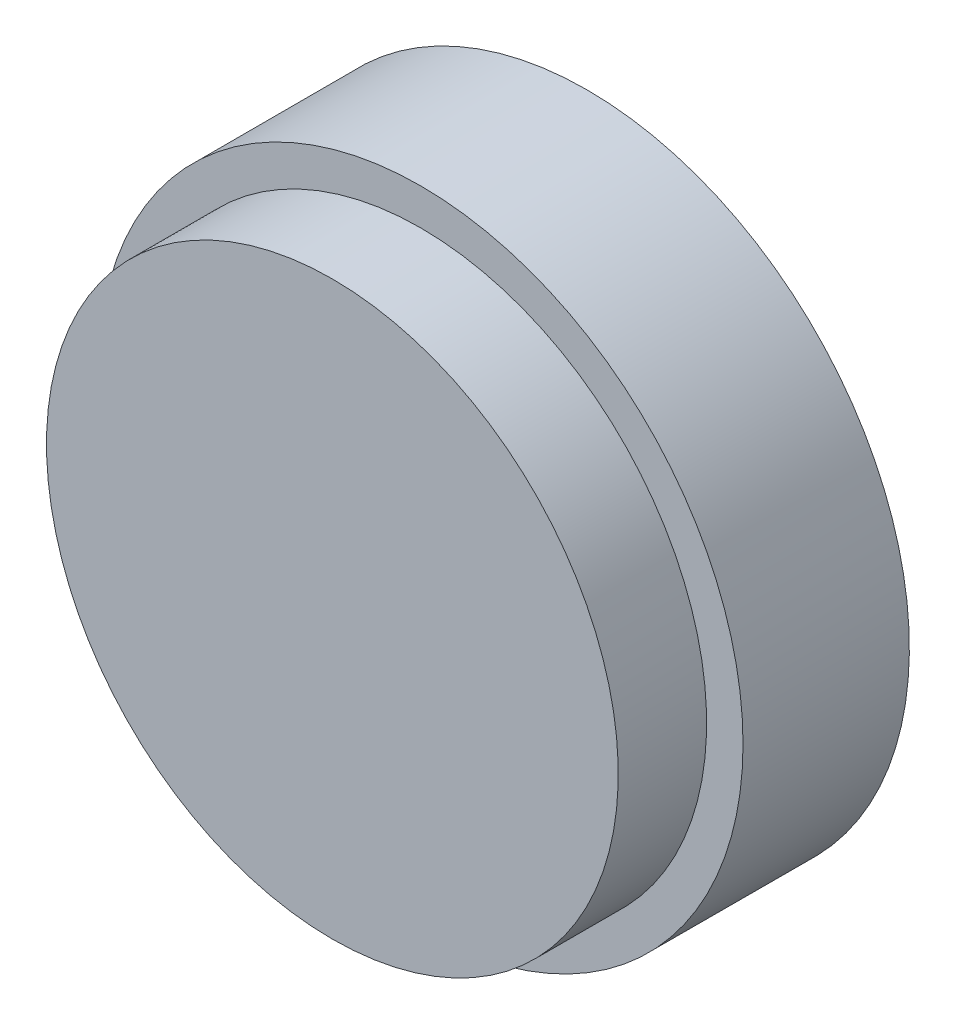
ISO-10303-21;
HEADER;
FILE_DESCRIPTION(('STEP AP214'),'2;1');
FILE_NAME('part.step','',(''),(''),'','','');
FILE_SCHEMA(('AUTOMOTIVE_DESIGN { 1 0 10303 214 1 1 1 1 }'));
ENDSEC;
DATA;
#1=APPLICATION_CONTEXT('core data for automotive mechanical design processes');
#2=APPLICATION_PROTOCOL_DEFINITION('international standard','automotive_design',2000,#1);
#3=PRODUCT_CONTEXT('',#1,'mechanical');
#4=PRODUCT('Part','Part','',(#3));
#5=PRODUCT_RELATED_PRODUCT_CATEGORY('part','',(#4));
#6=PRODUCT_DEFINITION_FORMATION('','',#4);
#7=PRODUCT_DEFINITION_CONTEXT('part definition',#1,'design');
#8=PRODUCT_DEFINITION('design','',#6,#7);
#9=PRODUCT_DEFINITION_SHAPE('','',#8);
#10=(LENGTH_UNIT() NAMED_UNIT(*) SI_UNIT(.MILLI.,.METRE.));
#11=(NAMED_UNIT(*) PLANE_ANGLE_UNIT() SI_UNIT($,.RADIAN.));
#12=(NAMED_UNIT(*) SI_UNIT($,.STERADIAN.) SOLID_ANGLE_UNIT());
#13=UNCERTAINTY_MEASURE_WITH_UNIT(LENGTH_MEASURE(1.E-05),#10,'distance_accuracy_value','');
#14=(GEOMETRIC_REPRESENTATION_CONTEXT(3) GLOBAL_UNCERTAINTY_ASSIGNED_CONTEXT((#13)) GLOBAL_UNIT_ASSIGNED_CONTEXT((#10,
#11,#12)) REPRESENTATION_CONTEXT('',''));
#15=CARTESIAN_POINT('',(0.,0.,0.));
#16=DIRECTION('',(0.,0.,1.));
#17=DIRECTION('',(1.,0.,0.));
#18=AXIS2_PLACEMENT_3D('',#15,#16,#17);
#19=CARTESIAN_POINT('',(-12.55,0.,-11.8798607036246));
#20=DIRECTION('',(0.,0.,-1.));
#21=DIRECTION('',(0.,-1.,0.));
#22=AXIS2_PLACEMENT_3D('',#19,#20,#21);
#23=PLANE('',#22);
#24=DIRECTION('',(0.499999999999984,-0.866025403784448,0.));
#25=VECTOR('',#24,1.);
#26=CARTESIAN_POINT('',(-5.30256350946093,4.18430940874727,-11.8798607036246));
#27=LINE('',#26,#25);
#28=CARTESIAN_POINT('',(-2.88675134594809,0.,-11.8798607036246));
#29=VERTEX_POINT('',#28);
#30=CARTESIAN_POINT('',(-1.4433756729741,-2.5,-11.8798607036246));
#31=VERTEX_POINT('',#30);
#32=EDGE_CURVE('E27',#29,#31,#27,.T.);
#33=ORIENTED_EDGE('',*,*,#32,.F.);
#34=DIRECTION('',(-0.499999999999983,-0.866025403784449,0.));
#35=VECTOR('',#34,1.);
#36=CARTESIAN_POINT('',(-5.3025635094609,-4.18430940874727,-11.8798607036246));
#37=LINE('',#36,#35);
#38=CARTESIAN_POINT('',(-1.4433756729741,2.5,-11.8798607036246));
#39=VERTEX_POINT('',#38);
#40=EDGE_CURVE('E145',#39,#29,#37,.T.);
#41=ORIENTED_EDGE('',*,*,#40,.F.);
#42=DIRECTION('',(-1.,0.,0.));
#43=VECTOR('',#42,1.);
#44=CARTESIAN_POINT('',(-12.55,2.50000000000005,-11.8798607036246));
#45=LINE('',#44,#43);
#46=CARTESIAN_POINT('',(1.4433756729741,2.5,-11.8798607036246));
#47=VERTEX_POINT('',#46);
#48=EDGE_CURVE('E141',#47,#39,#45,.T.);
#49=ORIENTED_EDGE('',*,*,#48,.F.);
#50=DIRECTION('',(-0.499999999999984,0.866025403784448,0.));
#51=VECTOR('',#50,1.);
#52=CARTESIAN_POINT('',(-0.972436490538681,6.6843094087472,-11.8798607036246));
#53=LINE('',#52,#51);
#54=CARTESIAN_POINT('',(2.88675134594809,0.,-11.8798607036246));
#55=VERTEX_POINT('',#54);
#56=EDGE_CURVE('E137',#55,#47,#53,.T.);
#57=ORIENTED_EDGE('',*,*,#56,.F.);
#58=DIRECTION('',(0.499999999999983,0.866025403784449,0.));
#59=VECTOR('',#58,1.);
#60=CARTESIAN_POINT('',(-0.972436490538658,-6.68430940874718,-11.8798607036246));
#61=LINE('',#60,#59);
#62=CARTESIAN_POINT('',(1.4433756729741,-2.5,-11.8798607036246));
#63=VERTEX_POINT('',#62);
#64=EDGE_CURVE('E133',#63,#55,#61,.T.);
#65=ORIENTED_EDGE('',*,*,#64,.F.);
#66=DIRECTION('',(1.,0.,0.));
#67=VECTOR('',#66,1.);
#68=CARTESIAN_POINT('',(-12.55,-2.49999999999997,-11.8798607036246));
#69=LINE('',#68,#67);
#70=EDGE_CURVE('E36',#31,#63,#69,.T.);
#71=ORIENTED_EDGE('',*,*,#70,.F.);
#72=EDGE_LOOP('',(#33,#41,#49,#57,#65,#71));
#73=FACE_BOUND('',#72,.T.);
#74=ADVANCED_FACE('F16',(#73),#23,.T.);
#75=CARTESIAN_POINT('',(-1.4433756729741,-2.5,-8.6798607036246));
#76=DIRECTION('',(0.,1.,0.));
#77=DIRECTION('',(0.,0.,-1.));
#78=AXIS2_PLACEMENT_3D('',#75,#76,#77);
#79=PLANE('',#78);
#80=DIRECTION('',(0.,0.,-1.));
#81=VECTOR('',#80,1.);
#82=CARTESIAN_POINT('',(-1.4433756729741,-2.5,-8.6798607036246));
#83=LINE('',#82,#81);
#84=CARTESIAN_POINT('',(-1.4433756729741,-2.5,-12.1798607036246));
#85=VERTEX_POINT('',#84);
#86=EDGE_CURVE('E58',#31,#85,#83,.T.);
#87=ORIENTED_EDGE('',*,*,#86,.F.);
#88=ORIENTED_EDGE('',*,*,#70,.T.);
#89=DIRECTION('',(0.,0.,-1.));
#90=VECTOR('',#89,1.);
#91=CARTESIAN_POINT('',(1.4433756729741,-2.5,-8.6798607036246));
#92=LINE('',#91,#90);
#93=CARTESIAN_POINT('',(1.4433756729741,-2.5,-12.1798607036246));
#94=VERTEX_POINT('',#93);
#95=EDGE_CURVE('E67',#63,#94,#92,.T.);
#96=ORIENTED_EDGE('',*,*,#95,.T.);
#97=DIRECTION('',(1.,0.,0.));
#98=VECTOR('',#97,1.);
#99=CARTESIAN_POINT('',(-1.4433756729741,-2.5,-12.1798607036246));
#100=LINE('',#99,#98);
#101=EDGE_CURVE('E69',#85,#94,#100,.T.);
#102=ORIENTED_EDGE('',*,*,#101,.F.);
#103=EDGE_LOOP('',(#87,#88,#96,#102));
#104=FACE_BOUND('',#103,.T.);
#105=ADVANCED_FACE('F70',(#104),#79,.T.);
#106=CARTESIAN_POINT('',(1.4433756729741,-2.5,-8.6798607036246));
#107=DIRECTION('',(-0.866025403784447,0.499999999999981,0.));
#108=DIRECTION('',(-0.499999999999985,-0.86602540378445,0.));
#109=AXIS2_PLACEMENT_3D('',#106,#107,#108);
#110=PLANE('',#109);
#111=ORIENTED_EDGE('',*,*,#95,.F.);
#112=ORIENTED_EDGE('',*,*,#64,.T.);
#113=DIRECTION('',(0.,0.,-1.));
#114=VECTOR('',#113,1.);
#115=CARTESIAN_POINT('',(2.8867513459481,0.,-8.6798607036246));
#116=LINE('',#115,#114);
#117=CARTESIAN_POINT('',(2.8867513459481,0.,-12.1798607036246));
#118=VERTEX_POINT('',#117);
#119=EDGE_CURVE('E98',#55,#118,#116,.T.);
#120=ORIENTED_EDGE('',*,*,#119,.T.);
#121=DIRECTION('',(0.499999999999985,0.86602540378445,0.));
#122=VECTOR('',#121,1.);
#123=CARTESIAN_POINT('',(1.4433756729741,-2.5,-12.1798607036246));
#124=LINE('',#123,#122);
#125=EDGE_CURVE('E76',#94,#118,#124,.T.);
#126=ORIENTED_EDGE('',*,*,#125,.F.);
#127=EDGE_LOOP('',(#111,#112,#120,#126));
#128=FACE_BOUND('',#127,.T.);
#129=ADVANCED_FACE('F241',(#128),#110,.T.);
#130=CARTESIAN_POINT('',(2.8867513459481,0.,-8.6798607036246));
#131=DIRECTION('',(-0.86602540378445,-0.499999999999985,0.));
#132=DIRECTION('',(0.499999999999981,-0.866025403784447,0.));
#133=AXIS2_PLACEMENT_3D('',#130,#131,#132);
#134=PLANE('',#133);
#135=ORIENTED_EDGE('',*,*,#119,.F.);
#136=ORIENTED_EDGE('',*,*,#56,.T.);
#137=DIRECTION('',(0.,0.,-1.));
#138=VECTOR('',#137,1.);
#139=CARTESIAN_POINT('',(1.4433756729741,2.5,-8.6798607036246));
#140=LINE('',#139,#138);
#141=CARTESIAN_POINT('',(1.4433756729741,2.5,-12.1798607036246));
#142=VERTEX_POINT('',#141);
#143=EDGE_CURVE('E95',#47,#142,#140,.T.);
#144=ORIENTED_EDGE('',*,*,#143,.T.);
#145=DIRECTION('',(-0.499999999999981,0.866025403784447,0.));
#146=VECTOR('',#145,1.);
#147=CARTESIAN_POINT('',(2.8867513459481,0.,-12.1798607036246));
#148=LINE('',#147,#146);
#149=EDGE_CURVE('E113',#118,#142,#148,.T.);
#150=ORIENTED_EDGE('',*,*,#149,.F.);
#151=EDGE_LOOP('',(#135,#136,#144,#150));
#152=FACE_BOUND('',#151,.T.);
#153=ADVANCED_FACE('F232',(#152),#134,.T.);
#154=CARTESIAN_POINT('',(0.,0.,-12.1798607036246));
#155=DIRECTION('',(0.,0.,-1.));
#156=DIRECTION('',(0.,-1.,0.));
#157=AXIS2_PLACEMENT_3D('',#154,#155,#156);
#158=PLANE('',#157);
#159=CARTESIAN_POINT('',(0.,0.,-12.1798607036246));
#160=DIRECTION('',(0.,0.,-1.));
#161=DIRECTION('',(0.,-1.,0.));
#162=AXIS2_PLACEMENT_3D('',#159,#160,#161);
#163=CIRCLE('',#162,4.95765862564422);
#164=CARTESIAN_POINT('',(0.,-4.95765862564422,-12.1798607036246));
#165=VERTEX_POINT('',#164);
#166=EDGE_CURVE('E20',#165,#165,#163,.F.);
#167=ORIENTED_EDGE('',*,*,#166,.F.);
#168=EDGE_LOOP('',(#167));
#169=FACE_BOUND('',#168,.T.);
#170=DIRECTION('',(-0.499999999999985,-0.86602540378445,0.));
#171=VECTOR('',#170,1.);
#172=CARTESIAN_POINT('',(-1.4433756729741,2.5,-12.1798607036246));
#173=LINE('',#172,#171);
#174=CARTESIAN_POINT('',(-1.4433756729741,2.5,-12.1798607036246));
#175=VERTEX_POINT('',#174);
#176=CARTESIAN_POINT('',(-2.8867513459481,0.,-12.1798607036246));
#177=VERTEX_POINT('',#176);
#178=EDGE_CURVE('E80',#175,#177,#173,.T.);
#179=ORIENTED_EDGE('',*,*,#178,.T.);
#180=DIRECTION('',(0.499999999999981,-0.866025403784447,0.));
#181=VECTOR('',#180,1.);
#182=CARTESIAN_POINT('',(-2.8867513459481,0.,-12.1798607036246));
#183=LINE('',#182,#181);
#184=EDGE_CURVE('E63',#177,#85,#183,.T.);
#185=ORIENTED_EDGE('',*,*,#184,.T.);
#186=ORIENTED_EDGE('',*,*,#101,.T.);
#187=ORIENTED_EDGE('',*,*,#125,.T.);
#188=ORIENTED_EDGE('',*,*,#149,.T.);
#189=DIRECTION('',(-1.,0.,0.));
#190=VECTOR('',#189,1.);
#191=CARTESIAN_POINT('',(1.4433756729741,2.5,-12.1798607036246));
#192=LINE('',#191,#190);
#193=EDGE_CURVE('E108',#142,#175,#192,.T.);
#194=ORIENTED_EDGE('',*,*,#193,.T.);
#195=EDGE_LOOP('',(#179,#185,#186,#187,#188,#194));
#196=FACE_BOUND('',#195,.T.);
#197=ADVANCED_FACE('F18',(#169,#196),#158,.T.);
#198=CARTESIAN_POINT('',(-2.8867513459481,0.,-8.6798607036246));
#199=DIRECTION('',(0.86602540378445,0.499999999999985,0.));
#200=DIRECTION('',(-0.499999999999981,0.866025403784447,0.));
#201=AXIS2_PLACEMENT_3D('',#198,#199,#200);
#202=PLANE('',#201);
#203=DIRECTION('',(0.,0.,-1.));
#204=VECTOR('',#203,1.);
#205=CARTESIAN_POINT('',(-2.8867513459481,0.,-8.6798607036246));
#206=LINE('',#205,#204);
#207=EDGE_CURVE('E88',#29,#177,#206,.T.);
#208=ORIENTED_EDGE('',*,*,#207,.F.);
#209=ORIENTED_EDGE('',*,*,#32,.T.);
#210=ORIENTED_EDGE('',*,*,#86,.T.);
#211=ORIENTED_EDGE('',*,*,#184,.F.);
#212=EDGE_LOOP('',(#208,#209,#210,#211));
#213=FACE_BOUND('',#212,.T.);
#214=ADVANCED_FACE('F61',(#213),#202,.T.);
#215=CARTESIAN_POINT('',(1.4433756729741,2.5,-8.6798607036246));
#216=DIRECTION('',(0.,-1.,0.));
#217=DIRECTION('',(0.,0.,1.));
#218=AXIS2_PLACEMENT_3D('',#215,#216,#217);
#219=PLANE('',#218);
#220=ORIENTED_EDGE('',*,*,#143,.F.);
#221=ORIENTED_EDGE('',*,*,#48,.T.);
#222=DIRECTION('',(0.,0.,-1.));
#223=VECTOR('',#222,1.);
#224=CARTESIAN_POINT('',(-1.4433756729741,2.5,-8.6798607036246));
#225=LINE('',#224,#223);
#226=EDGE_CURVE('E92',#39,#175,#225,.T.);
#227=ORIENTED_EDGE('',*,*,#226,.T.);
#228=ORIENTED_EDGE('',*,*,#193,.F.);
#229=EDGE_LOOP('',(#220,#221,#227,#228));
#230=FACE_BOUND('',#229,.T.);
#231=ADVANCED_FACE('F239',(#230),#219,.T.);
#232=CARTESIAN_POINT('',(-1.4433756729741,2.5,-8.6798607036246));
#233=DIRECTION('',(0.866025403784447,-0.499999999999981,0.));
#234=DIRECTION('',(0.499999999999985,0.86602540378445,0.));
#235=AXIS2_PLACEMENT_3D('',#232,#233,#234);
#236=PLANE('',#235);
#237=ORIENTED_EDGE('',*,*,#226,.F.);
#238=ORIENTED_EDGE('',*,*,#40,.T.);
#239=ORIENTED_EDGE('',*,*,#207,.T.);
#240=ORIENTED_EDGE('',*,*,#178,.F.);
#241=EDGE_LOOP('',(#237,#238,#239,#240));
#242=FACE_BOUND('',#241,.T.);
#243=ADVANCED_FACE('F256',(#242),#236,.T.);
#244=CARTESIAN_POINT('',(0.,0.,-11.6164501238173));
#245=DIRECTION('',(0.,0.,-1.));
#246=DIRECTION('',(0.,-1.,0.));
#247=AXIS2_PLACEMENT_3D('',#244,#245,#246);
#248=CONICAL_SURFACE('',#247,4.9400692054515,0.0312094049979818);
#249=CARTESIAN_POINT('',(0.,0.,-11.8798607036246));
#250=DIRECTION('',(0.,0.,-1.));
#251=DIRECTION('',(-1.,0.,0.));
#252=AXIS2_PLACEMENT_3D('',#249,#250,#251);
#253=CIRCLE('',#252,4.9482927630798);
#254=CARTESIAN_POINT('',(-4.9482927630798,0.,-11.8798607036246));
#255=VERTEX_POINT('',#254);
#256=EDGE_CURVE('E9',#255,#255,#253,.T.);
#257=ORIENTED_EDGE('',*,*,#256,.T.);
#258=EDGE_LOOP('',(#257));
#259=FACE_BOUND('',#258,.T.);
#260=ORIENTED_EDGE('',*,*,#166,.T.);
#261=EDGE_LOOP('',(#260));
#262=FACE_BOUND('',#261,.T.);
#263=ADVANCED_FACE('F229',(#259,#262),#248,.T.);
#264=ORIENTED_EDGE('',*,*,#256,.F.);
#265=EDGE_LOOP('',(#264));
#266=FACE_BOUND('',#265,.T.);
#267=CARTESIAN_POINT('',(0.,0.,-11.8798607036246));
#268=DIRECTION('',(0.,0.,-1.));
#269=DIRECTION('',(0.,-1.,0.));
#270=AXIS2_PLACEMENT_3D('',#267,#268,#269);
#271=CIRCLE('',#270,13.);
#272=CARTESIAN_POINT('',(0.,-13.,-11.8798607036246));
#273=VERTEX_POINT('',#272);
#274=EDGE_CURVE('E149',#273,#273,#271,.T.);
#275=ORIENTED_EDGE('',*,*,#274,.T.);
#276=EDGE_LOOP('',(#275));
#277=FACE_BOUND('',#276,.T.);
#278=ADVANCED_FACE('F254',(#266,#277),#23,.T.);
#279=CARTESIAN_POINT('',(0.,0.,-8.8798607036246));
#280=DIRECTION('',(0.,0.,1.));
#281=DIRECTION('',(0.,1.,0.));
#282=AXIS2_PLACEMENT_3D('',#279,#280,#281);
#283=CYLINDRICAL_SURFACE('',#282,12.55);
#284=CARTESIAN_POINT('',(0.,0.,-35.8798607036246));
#285=DIRECTION('',(0.,0.,-1.));
#286=DIRECTION('',(0.,-1.,0.));
#287=AXIS2_PLACEMENT_3D('',#284,#285,#286);
#288=CIRCLE('',#287,12.55);
#289=CARTESIAN_POINT('',(0.,-12.55,-35.8798607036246));
#290=VERTEX_POINT('',#289);
#291=EDGE_CURVE('E150',#290,#290,#288,.F.);
#292=ORIENTED_EDGE('',*,*,#291,.F.);
#293=EDGE_LOOP('',(#292));
#294=FACE_BOUND('',#293,.T.);
#295=CARTESIAN_POINT('',(0.,0.,-33.8798607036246));
#296=DIRECTION('',(0.,0.,1.));
#297=DIRECTION('',(0.,1.,0.));
#298=AXIS2_PLACEMENT_3D('',#295,#296,#297);
#299=CIRCLE('',#298,12.55);
#300=CARTESIAN_POINT('',(0.,12.55,-33.8798607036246));
#301=VERTEX_POINT('',#300);
#302=EDGE_CURVE('E181',#301,#301,#299,.T.);
#303=ORIENTED_EDGE('',*,*,#302,.T.);
#304=EDGE_LOOP('',(#303));
#305=FACE_BOUND('',#304,.T.);
#306=ADVANCED_FACE('F263',(#294,#305),#283,.F.);
#307=CARTESIAN_POINT('',(0.,0.,-30.6798607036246));
#308=DIRECTION('',(0.,0.,1.));
#309=DIRECTION('',(0.,1.,0.));
#310=AXIS2_PLACEMENT_3D('',#307,#308,#309);
#311=CIRCLE('',#310,12.55);
#312=CARTESIAN_POINT('',(0.,12.55,-30.6798607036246));
#313=VERTEX_POINT('',#312);
#314=EDGE_CURVE('E193',#313,#313,#311,.T.);
#315=ORIENTED_EDGE('',*,*,#314,.F.);
#316=EDGE_LOOP('',(#315));
#317=FACE_BOUND('',#316,.T.);
#318=CARTESIAN_POINT('',(0.,0.,-28.8798607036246));
#319=DIRECTION('',(0.,0.,1.));
#320=DIRECTION('',(0.,1.,0.));
#321=AXIS2_PLACEMENT_3D('',#318,#319,#320);
#322=CIRCLE('',#321,12.55);
#323=CARTESIAN_POINT('',(0.,12.55,-28.8798607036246));
#324=VERTEX_POINT('',#323);
#325=EDGE_CURVE('E165',#324,#324,#322,.T.);
#326=ORIENTED_EDGE('',*,*,#325,.T.);
#327=EDGE_LOOP('',(#326));
#328=FACE_BOUND('',#327,.T.);
#329=ADVANCED_FACE('F311',(#317,#328),#283,.F.);
#330=CARTESIAN_POINT('',(0.,0.,-8.8798607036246));
#331=DIRECTION('',(0.,0.,1.));
#332=DIRECTION('',(0.,1.,0.));
#333=AXIS2_PLACEMENT_3D('',#330,#331,#332);
#334=CYLINDRICAL_SURFACE('',#333,17.5);
#335=CARTESIAN_POINT('',(0.,0.,-35.8798607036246));
#336=DIRECTION('',(0.,0.,-1.));
#337=DIRECTION('',(0.,-1.,0.));
#338=AXIS2_PLACEMENT_3D('',#335,#336,#337);
#339=CIRCLE('',#338,17.5);
#340=CARTESIAN_POINT('',(0.,-17.5,-35.8798607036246));
#341=VERTEX_POINT('',#340);
#342=EDGE_CURVE('E154',#341,#341,#339,.F.);
#343=ORIENTED_EDGE('',*,*,#342,.T.);
#344=EDGE_LOOP('',(#343));
#345=FACE_BOUND('',#344,.T.);
#346=CARTESIAN_POINT('',(0.,0.,-13.3798607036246));
#347=DIRECTION('',(0.,0.,1.));
#348=DIRECTION('',(0.,1.,0.));
#349=AXIS2_PLACEMENT_3D('',#346,#347,#348);
#350=CIRCLE('',#349,17.5);
#351=CARTESIAN_POINT('',(0.,17.5,-13.3798607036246));
#352=VERTEX_POINT('',#351);
#353=EDGE_CURVE('E209',#352,#352,#350,.T.);
#354=ORIENTED_EDGE('',*,*,#353,.F.);
#355=EDGE_LOOP('',(#354));
#356=FACE_BOUND('',#355,.T.);
#357=ADVANCED_FACE('F307',(#345,#356),#334,.T.);
#358=CARTESIAN_POINT('',(-17.5,0.,-35.8798607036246));
#359=DIRECTION('',(0.,0.,-1.));
#360=DIRECTION('',(0.,-1.,0.));
#361=AXIS2_PLACEMENT_3D('',#358,#359,#360);
#362=PLANE('',#361);
#363=ORIENTED_EDGE('',*,*,#342,.F.);
#364=EDGE_LOOP('',(#363));
#365=FACE_BOUND('',#364,.T.);
#366=ORIENTED_EDGE('',*,*,#291,.T.);
#367=EDGE_LOOP('',(#366));
#368=FACE_BOUND('',#367,.T.);
#369=ADVANCED_FACE('F303',(#365,#368),#362,.T.);
#370=CARTESIAN_POINT('',(0.,0.,-24.3798607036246));
#371=DIRECTION('',(0.,0.,1.));
#372=DIRECTION('',(0.,1.,0.));
#373=AXIS2_PLACEMENT_3D('',#370,#371,#372);
#374=CONICAL_SURFACE('',#373,13.3434714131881,0.174532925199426);
#375=ORIENTED_EDGE('',*,*,#325,.F.);
#376=EDGE_LOOP('',(#375));
#377=FACE_BOUND('',#376,.T.);
#378=CARTESIAN_POINT('',(0.,0.,-24.3798607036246));
#379=DIRECTION('',(0.,0.,1.));
#380=DIRECTION('',(0.,1.,0.));
#381=AXIS2_PLACEMENT_3D('',#378,#379,#380);
#382=CIRCLE('',#381,13.3434714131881);
#383=CARTESIAN_POINT('',(0.,13.3434714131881,-24.3798607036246));
#384=VERTEX_POINT('',#383);
#385=EDGE_CURVE('E169',#384,#384,#382,.T.);
#386=ORIENTED_EDGE('',*,*,#385,.T.);
#387=EDGE_LOOP('',(#386));
#388=FACE_BOUND('',#387,.T.);
#389=ADVANCED_FACE('F295',(#377,#388),#374,.F.);
#390=CARTESIAN_POINT('',(-13.3434714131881,0.,-24.3798607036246));
#391=DIRECTION('',(0.,0.,-1.));
#392=DIRECTION('',(0.,-1.,0.));
#393=AXIS2_PLACEMENT_3D('',#390,#391,#392);
#394=PLANE('',#393);
#395=ORIENTED_EDGE('',*,*,#385,.F.);
#396=EDGE_LOOP('',(#395));
#397=FACE_BOUND('',#396,.T.);
#398=CARTESIAN_POINT('',(0.,0.,-24.3798607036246));
#399=DIRECTION('',(0.,0.,1.));
#400=DIRECTION('',(0.,1.,0.));
#401=AXIS2_PLACEMENT_3D('',#398,#399,#400);
#402=CIRCLE('',#401,14.75);
#403=CARTESIAN_POINT('',(0.,14.75,-24.3798607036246));
#404=VERTEX_POINT('',#403);
#405=EDGE_CURVE('E173',#404,#404,#402,.T.);
#406=ORIENTED_EDGE('',*,*,#405,.T.);
#407=EDGE_LOOP('',(#406));
#408=FACE_BOUND('',#407,.T.);
#409=ADVANCED_FACE('F288',(#397,#408),#394,.F.);
#410=CARTESIAN_POINT('',(0.,0.,-8.8798607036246));
#411=DIRECTION('',(0.,0.,1.));
#412=DIRECTION('',(0.,1.,0.));
#413=AXIS2_PLACEMENT_3D('',#410,#411,#412);
#414=CYLINDRICAL_SURFACE('',#413,14.75);
#415=ORIENTED_EDGE('',*,*,#405,.F.);
#416=EDGE_LOOP('',(#415));
#417=FACE_BOUND('',#416,.T.);
#418=CARTESIAN_POINT('',(0.,0.,-17.8798607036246));
#419=DIRECTION('',(0.,0.,1.));
#420=DIRECTION('',(0.,1.,0.));
#421=AXIS2_PLACEMENT_3D('',#418,#419,#420);
#422=CIRCLE('',#421,14.75);
#423=CARTESIAN_POINT('',(0.,14.75,-17.8798607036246));
#424=VERTEX_POINT('',#423);
#425=EDGE_CURVE('E177',#424,#424,#422,.T.);
#426=ORIENTED_EDGE('',*,*,#425,.T.);
#427=EDGE_LOOP('',(#426));
#428=FACE_BOUND('',#427,.T.);
#429=ADVANCED_FACE('F283',(#417,#428),#414,.F.);
#430=CARTESIAN_POINT('',(-14.75,0.,-17.8798607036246));
#431=DIRECTION('',(0.,0.,1.));
#432=DIRECTION('',(0.,1.,0.));
#433=AXIS2_PLACEMENT_3D('',#430,#431,#432);
#434=PLANE('',#433);
#435=CARTESIAN_POINT('',(0.,0.,-17.8798607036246));
#436=DIRECTION('',(0.,0.,-1.));
#437=DIRECTION('',(0.,-1.,0.));
#438=AXIS2_PLACEMENT_3D('',#435,#436,#437);
#439=CIRCLE('',#438,13.);
#440=CARTESIAN_POINT('',(0.,-13.,-17.8798607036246));
#441=VERTEX_POINT('',#440);
#442=EDGE_CURVE('E205',#441,#441,#439,.T.);
#443=ORIENTED_EDGE('',*,*,#442,.F.);
#444=EDGE_LOOP('',(#443));
#445=FACE_BOUND('',#444,.T.);
#446=ORIENTED_EDGE('',*,*,#425,.F.);
#447=EDGE_LOOP('',(#446));
#448=FACE_BOUND('',#447,.T.);
#449=ADVANCED_FACE('F279',(#445,#448),#434,.F.);
#450=CARTESIAN_POINT('',(-12.55,0.,-33.8798607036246));
#451=DIRECTION('',(0.,0.,-1.));
#452=DIRECTION('',(0.,-1.,0.));
#453=AXIS2_PLACEMENT_3D('',#450,#451,#452);
#454=PLANE('',#453);
#455=ORIENTED_EDGE('',*,*,#302,.F.);
#456=EDGE_LOOP('',(#455));
#457=FACE_BOUND('',#456,.T.);
#458=CARTESIAN_POINT('',(0.,0.,-33.8798607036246));
#459=DIRECTION('',(0.,0.,1.));
#460=DIRECTION('',(0.,1.,0.));
#461=AXIS2_PLACEMENT_3D('',#458,#459,#460);
#462=CIRCLE('',#461,14.4);
#463=CARTESIAN_POINT('',(0.,14.4,-33.8798607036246));
#464=VERTEX_POINT('',#463);
#465=EDGE_CURVE('E185',#464,#464,#462,.T.);
#466=ORIENTED_EDGE('',*,*,#465,.T.);
#467=EDGE_LOOP('',(#466));
#468=FACE_BOUND('',#467,.T.);
#469=ADVANCED_FACE('F282',(#457,#468),#454,.F.);
#470=CARTESIAN_POINT('',(0.,0.,-8.8798607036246));
#471=DIRECTION('',(0.,0.,1.));
#472=DIRECTION('',(0.,1.,0.));
#473=AXIS2_PLACEMENT_3D('',#470,#471,#472);
#474=CYLINDRICAL_SURFACE('',#473,14.4);
#475=ORIENTED_EDGE('',*,*,#465,.F.);
#476=EDGE_LOOP('',(#475));
#477=FACE_BOUND('',#476,.T.);
#478=CARTESIAN_POINT('',(0.,0.,-30.6798607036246));
#479=DIRECTION('',(0.,0.,1.));
#480=DIRECTION('',(0.,1.,0.));
#481=AXIS2_PLACEMENT_3D('',#478,#479,#480);
#482=CIRCLE('',#481,14.4);
#483=CARTESIAN_POINT('',(0.,14.4,-30.6798607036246));
#484=VERTEX_POINT('',#483);
#485=EDGE_CURVE('E189',#484,#484,#482,.T.);
#486=ORIENTED_EDGE('',*,*,#485,.T.);
#487=EDGE_LOOP('',(#486));
#488=FACE_BOUND('',#487,.T.);
#489=ADVANCED_FACE('F428',(#477,#488),#474,.F.);
#490=CARTESIAN_POINT('',(-12.55,0.,-30.6798607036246));
#491=DIRECTION('',(0.,0.,1.));
#492=DIRECTION('',(0.,1.,0.));
#493=AXIS2_PLACEMENT_3D('',#490,#491,#492);
#494=PLANE('',#493);
#495=ORIENTED_EDGE('',*,*,#485,.F.);
#496=EDGE_LOOP('',(#495));
#497=FACE_BOUND('',#496,.T.);
#498=ORIENTED_EDGE('',*,*,#314,.T.);
#499=EDGE_LOOP('',(#498));
#500=FACE_BOUND('',#499,.T.);
#501=ADVANCED_FACE('F275',(#497,#500),#494,.F.);
#502=CARTESIAN_POINT('',(0.,0.,-8.8798607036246));
#503=DIRECTION('',(0.,0.,-1.));
#504=DIRECTION('',(0.,-1.,0.));
#505=AXIS2_PLACEMENT_3D('',#502,#503,#504);
#506=CYLINDRICAL_SURFACE('',#505,13.);
#507=ORIENTED_EDGE('',*,*,#274,.F.);
#508=EDGE_LOOP('',(#507));
#509=FACE_BOUND('',#508,.T.);
#510=ORIENTED_EDGE('',*,*,#442,.T.);
#511=EDGE_LOOP('',(#510));
#512=FACE_BOUND('',#511,.T.);
#513=ADVANCED_FACE('F271',(#509,#512),#506,.F.);
#514=CARTESIAN_POINT('',(17.5,0.,-13.3798607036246));
#515=DIRECTION('',(0.,0.,-1.));
#516=DIRECTION('',(0.,-1.,0.));
#517=AXIS2_PLACEMENT_3D('',#514,#515,#516);
#518=PLANE('',#517);
#519=ORIENTED_EDGE('',*,*,#353,.T.);
#520=EDGE_LOOP('',(#519));
#521=FACE_BOUND('',#520,.T.);
#522=CARTESIAN_POINT('',(0.,0.,-13.3798607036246));
#523=DIRECTION('',(0.,0.,1.));
#524=DIRECTION('',(0.,1.,0.));
#525=AXIS2_PLACEMENT_3D('',#522,#523,#524);
#526=CIRCLE('',#525,25.5);
#527=CARTESIAN_POINT('',(0.,25.5,-13.3798607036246));
#528=VERTEX_POINT('',#527);
#529=EDGE_CURVE('E213',#528,#528,#526,.T.);
#530=ORIENTED_EDGE('',*,*,#529,.F.);
#531=EDGE_LOOP('',(#530));
#532=FACE_BOUND('',#531,.T.);
#533=ADVANCED_FACE('F274',(#521,#532),#518,.T.);
#534=CARTESIAN_POINT('',(0.,0.,-8.8798607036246));
#535=DIRECTION('',(0.,0.,1.));
#536=DIRECTION('',(0.,1.,0.));
#537=AXIS2_PLACEMENT_3D('',#534,#535,#536);
#538=CYLINDRICAL_SURFACE('',#537,25.5);
#539=ORIENTED_EDGE('',*,*,#529,.T.);
#540=EDGE_LOOP('',(#539));
#541=FACE_BOUND('',#540,.T.);
#542=CARTESIAN_POINT('',(0.,0.,-29.3798607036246));
#543=DIRECTION('',(0.,0.,1.));
#544=DIRECTION('',(0.,1.,0.));
#545=AXIS2_PLACEMENT_3D('',#542,#543,#544);
#546=CIRCLE('',#545,25.5);
#547=CARTESIAN_POINT('',(0.,25.5,-29.3798607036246));
#548=VERTEX_POINT('',#547);
#549=EDGE_CURVE('E217',#548,#548,#546,.T.);
#550=ORIENTED_EDGE('',*,*,#549,.F.);
#551=EDGE_LOOP('',(#550));
#552=FACE_BOUND('',#551,.T.);
#553=ADVANCED_FACE('F321',(#541,#552),#538,.F.);
#554=CARTESIAN_POINT('',(0.,0.,-8.8798607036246));
#555=DIRECTION('',(0.,0.,1.));
#556=DIRECTION('',(0.,1.,0.));
#557=AXIS2_PLACEMENT_3D('',#554,#555,#556);
#558=CYLINDRICAL_SURFACE('',#557,31.);
#559=CARTESIAN_POINT('',(0.,0.,-29.3798607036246));
#560=DIRECTION('',(0.,0.,1.));
#561=DIRECTION('',(0.,1.,0.));
#562=AXIS2_PLACEMENT_3D('',#559,#560,#561);
#563=CIRCLE('',#562,31.);
#564=CARTESIAN_POINT('',(0.,31.,-29.3798607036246));
#565=VERTEX_POINT('',#564);
#566=EDGE_CURVE('E155',#565,#565,#563,.T.);
#567=ORIENTED_EDGE('',*,*,#566,.T.);
#568=EDGE_LOOP('',(#567));
#569=FACE_BOUND('',#568,.T.);
#570=CARTESIAN_POINT('',(0.,0.,-13.3798607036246));
#571=DIRECTION('',(0.,0.,-1.));
#572=DIRECTION('',(0.,-1.,0.));
#573=AXIS2_PLACEMENT_3D('',#570,#571,#572);
#574=CIRCLE('',#573,31.);
#575=CARTESIAN_POINT('',(0.,-31.,-13.3798607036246));
#576=VERTEX_POINT('',#575);
#577=EDGE_CURVE('E197',#576,#576,#574,.T.);
#578=ORIENTED_EDGE('',*,*,#577,.T.);
#579=EDGE_LOOP('',(#578));
#580=FACE_BOUND('',#579,.T.);
#581=ADVANCED_FACE('F317',(#569,#580),#558,.T.);
#582=CARTESIAN_POINT('',(-17.5,0.,-29.3798607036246));
#583=DIRECTION('',(0.,0.,-1.));
#584=DIRECTION('',(0.,-1.,0.));
#585=AXIS2_PLACEMENT_3D('',#582,#583,#584);
#586=PLANE('',#585);
#587=ORIENTED_EDGE('',*,*,#549,.T.);
#588=EDGE_LOOP('',(#587));
#589=FACE_BOUND('',#588,.T.);
#590=ORIENTED_EDGE('',*,*,#566,.F.);
#591=EDGE_LOOP('',(#590));
#592=FACE_BOUND('',#591,.T.);
#593=ADVANCED_FACE('F313',(#589,#592),#586,.T.);
#594=CARTESIAN_POINT('',(0.,0.,-4.8798607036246));
#595=DIRECTION('',(0.,0.,-1.));
#596=DIRECTION('',(0.,-1.,0.));
#597=AXIS2_PLACEMENT_3D('',#594,#595,#596);
#598=PLANE('',#597);
#599=CARTESIAN_POINT('',(0.,0.,-4.8798607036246));
#600=DIRECTION('',(0.,0.,-1.));
#601=DIRECTION('',(0.,-1.,0.));
#602=AXIS2_PLACEMENT_3D('',#599,#600,#601);
#603=CIRCLE('',#602,27.5);
#604=CARTESIAN_POINT('',(0.,-27.5,-4.8798607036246));
#605=VERTEX_POINT('',#604);
#606=EDGE_CURVE('E221',#605,#605,#603,.T.);
#607=ORIENTED_EDGE('',*,*,#606,.F.);
#608=EDGE_LOOP('',(#607));
#609=FACE_BOUND('',#608,.T.);
#610=ADVANCED_FACE('F316',(#609),#598,.F.);
#611=CARTESIAN_POINT('',(0.,0.,-8.8798607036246));
#612=DIRECTION('',(0.,0.,-1.));
#613=DIRECTION('',(0.,-1.,0.));
#614=AXIS2_PLACEMENT_3D('',#611,#612,#613);
#615=CYLINDRICAL_SURFACE('',#614,27.5);
#616=CARTESIAN_POINT('',(0.,0.,-13.3798607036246));
#617=DIRECTION('',(0.,0.,-1.));
#618=DIRECTION('',(0.,-1.,0.));
#619=AXIS2_PLACEMENT_3D('',#616,#617,#618);
#620=CIRCLE('',#619,27.5);
#621=CARTESIAN_POINT('',(0.,-27.5,-13.3798607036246));
#622=VERTEX_POINT('',#621);
#623=EDGE_CURVE('E201',#622,#622,#620,.T.);
#624=ORIENTED_EDGE('',*,*,#623,.F.);
#625=EDGE_LOOP('',(#624));
#626=FACE_BOUND('',#625,.T.);
#627=ORIENTED_EDGE('',*,*,#606,.T.);
#628=EDGE_LOOP('',(#627));
#629=FACE_BOUND('',#628,.T.);
#630=ADVANCED_FACE('F488',(#626,#629),#615,.T.);
#631=CARTESIAN_POINT('',(-31.,0.,-13.3798607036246));
#632=DIRECTION('',(0.,0.,1.));
#633=DIRECTION('',(0.,1.,0.));
#634=AXIS2_PLACEMENT_3D('',#631,#632,#633);
#635=PLANE('',#634);
#636=ORIENTED_EDGE('',*,*,#623,.T.);
#637=EDGE_LOOP('',(#636));
#638=FACE_BOUND('',#637,.T.);
#639=ORIENTED_EDGE('',*,*,#577,.F.);
#640=EDGE_LOOP('',(#639));
#641=FACE_BOUND('',#640,.T.);
#642=ADVANCED_FACE('F498',(#638,#641),#635,.T.);
#643=CLOSED_SHELL('',(#74,#105,#129,#153,#197,#214,#231,#243,#263,#278,#306,#329,#357,#369,#389,
#409,#429,#449,#469,#489,#501,#513,#533,#553,#581,#593,#610,#630,#642));
#644=MANIFOLD_SOLID_BREP('B1',#643);
#645=ADVANCED_BREP_SHAPE_REPRESENTATION('',(#18,#644),#14);
#646=SHAPE_DEFINITION_REPRESENTATION(#9,#645);
ENDSEC;
END-ISO-10303-21;
